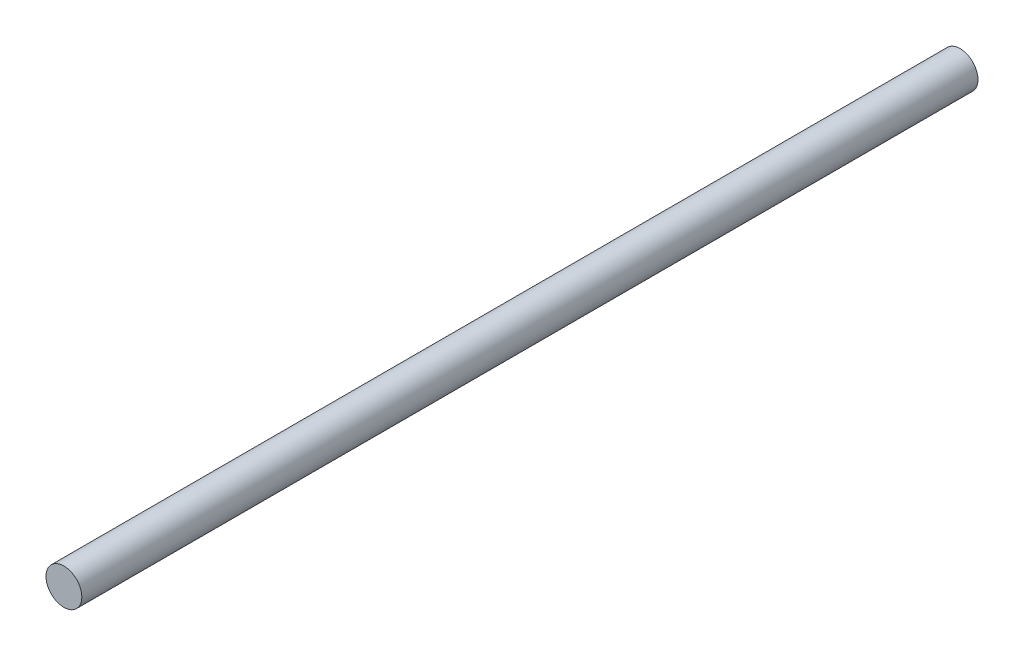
from build123d import *

# Parameters (mm, degrees)
SKETCH1_R           = 30
BOSS_EXTRUDE1_DEPTH = 1500


with BuildPart() as part:
    # Sketch1 → Boss-Extrude1 (new body)
    with BuildSketch(Plane.XY):
        Circle(SKETCH1_R)
    extrude(amount=-BOSS_EXTRUDE1_DEPTH)


solid = part.part
